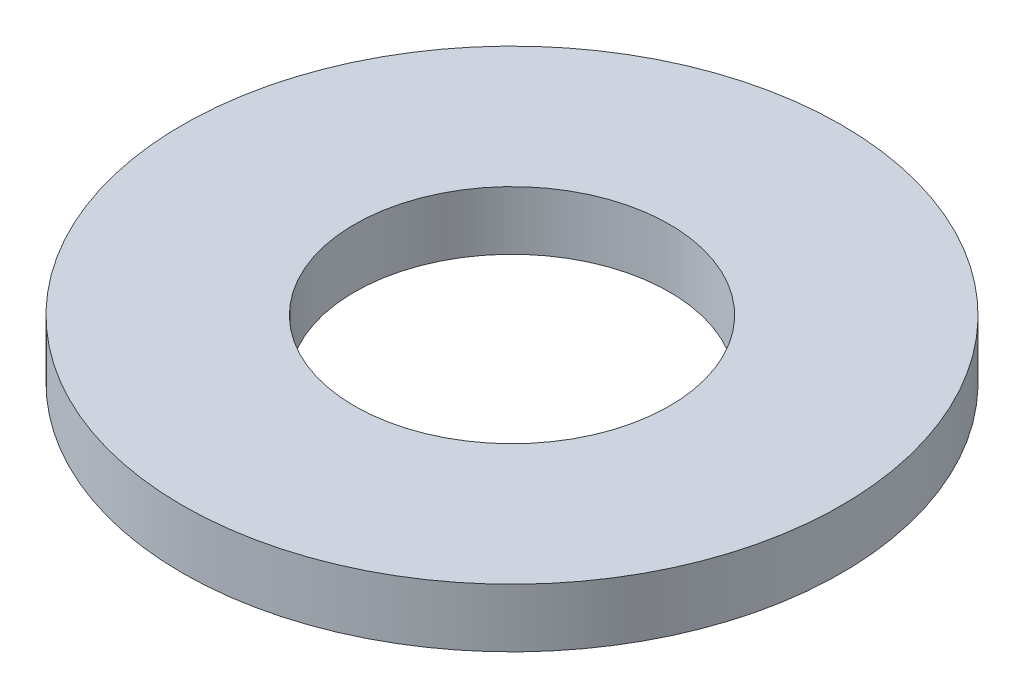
from build123d import *

# Parameters (mm, degrees)
SKETCH1_R      = 4.5
SKETCH1_R_2    = 2.15
EXTRUDE1_DEPTH = 0.8


with BuildPart() as part:
    # Sketch1 → Extrude1 (new body)
    with BuildSketch(Plane(origin=(0, 0, 0), x_dir=(1, 0, 0), z_dir=(0, 1, 0))):
        with Locations(Location((0, 0, 0), (0, 0, 270))):
            Circle(SKETCH1_R)
        with Locations(Location((0, 0, 0), (0, 0, 270))):
            Circle(SKETCH1_R_2, mode=Mode.SUBTRACT)
    extrude(amount=EXTRUDE1_DEPTH)


solid = part.part
